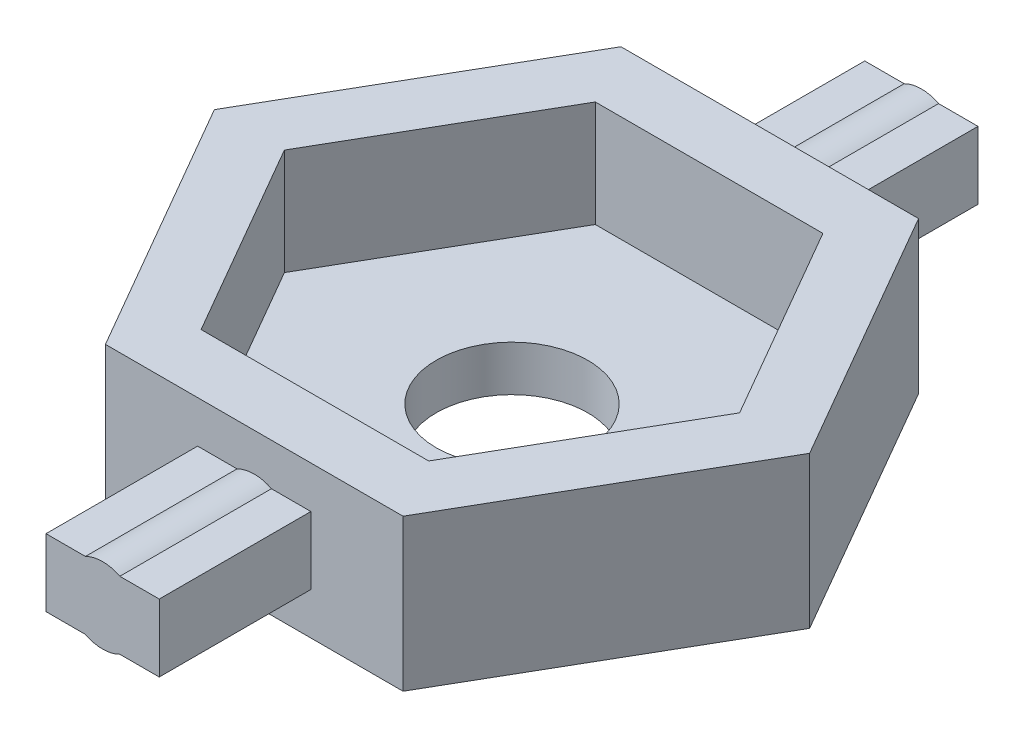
ISO-10303-21;
HEADER;
FILE_DESCRIPTION(('STEP AP214'),'2;1');
FILE_NAME('part.step','',(''),(''),'','','');
FILE_SCHEMA(('AUTOMOTIVE_DESIGN { 1 0 10303 214 1 1 1 1 }'));
ENDSEC;
DATA;
#1=APPLICATION_CONTEXT('core data for automotive mechanical design processes');
#2=APPLICATION_PROTOCOL_DEFINITION('international standard','automotive_design',2000,#1);
#3=PRODUCT_CONTEXT('',#1,'mechanical');
#4=PRODUCT('Part','Part','',(#3));
#5=PRODUCT_RELATED_PRODUCT_CATEGORY('part','',(#4));
#6=PRODUCT_DEFINITION_FORMATION('','',#4);
#7=PRODUCT_DEFINITION_CONTEXT('part definition',#1,'design');
#8=PRODUCT_DEFINITION('design','',#6,#7);
#9=PRODUCT_DEFINITION_SHAPE('','',#8);
#10=(LENGTH_UNIT() NAMED_UNIT(*) SI_UNIT(.MILLI.,.METRE.));
#11=(NAMED_UNIT(*) PLANE_ANGLE_UNIT() SI_UNIT($,.RADIAN.));
#12=(NAMED_UNIT(*) SI_UNIT($,.STERADIAN.) SOLID_ANGLE_UNIT());
#13=UNCERTAINTY_MEASURE_WITH_UNIT(LENGTH_MEASURE(1.E-05),#10,'distance_accuracy_value','');
#14=(GEOMETRIC_REPRESENTATION_CONTEXT(3) GLOBAL_UNCERTAINTY_ASSIGNED_CONTEXT((#13)) GLOBAL_UNIT_ASSIGNED_CONTEXT((#10,
#11,#12)) REPRESENTATION_CONTEXT('',''));
#15=CARTESIAN_POINT('',(0.,0.,0.));
#16=DIRECTION('',(0.,0.,1.));
#17=DIRECTION('',(1.,0.,0.));
#18=AXIS2_PLACEMENT_3D('',#15,#16,#17);
#19=CARTESIAN_POINT('',(0.,2.5,4.25));
#20=DIRECTION('',(0.,0.,-1.));
#21=DIRECTION('',(-1.,0.,0.));
#22=AXIS2_PLACEMENT_3D('',#19,#20,#21);
#23=PLANE('',#22);
#24=DIRECTION('',(1.,0.,0.));
#25=VECTOR('',#24,1.);
#26=CARTESIAN_POINT('',(0.,0.,4.25));
#27=LINE('',#26,#25);
#28=CARTESIAN_POINT('',(-2.45373864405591,0.,4.25));
#29=VERTEX_POINT('',#28);
#30=CARTESIAN_POINT('',(2.45373864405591,0.,4.25));
#31=VERTEX_POINT('',#30);
#32=EDGE_CURVE('E382',#29,#31,#27,.T.);
#33=ORIENTED_EDGE('',*,*,#32,.T.);
#34=DIRECTION('',(0.,-1.,0.));
#35=VECTOR('',#34,1.);
#36=CARTESIAN_POINT('',(2.45373864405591,2.5,4.25));
#37=LINE('',#36,#35);
#38=CARTESIAN_POINT('',(2.45373864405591,2.5,4.25));
#39=VERTEX_POINT('',#38);
#40=EDGE_CURVE('E492',#39,#31,#37,.T.);
#41=ORIENTED_EDGE('',*,*,#40,.F.);
#42=DIRECTION('',(1.,0.,0.));
#43=VECTOR('',#42,1.);
#44=CARTESIAN_POINT('',(0.,2.5,4.25));
#45=LINE('',#44,#43);
#46=CARTESIAN_POINT('',(-2.45373864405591,2.5,4.25));
#47=VERTEX_POINT('',#46);
#48=EDGE_CURVE('E434',#47,#39,#45,.T.);
#49=ORIENTED_EDGE('',*,*,#48,.F.);
#50=DIRECTION('',(0.,-1.,0.));
#51=VECTOR('',#50,1.);
#52=CARTESIAN_POINT('',(-2.45373864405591,2.5,4.25));
#53=LINE('',#52,#51);
#54=EDGE_CURVE('E471',#47,#29,#53,.T.);
#55=ORIENTED_EDGE('',*,*,#54,.T.);
#56=EDGE_LOOP('',(#33,#41,#49,#55));
#57=FACE_BOUND('',#56,.T.);
#58=CARTESIAN_POINT('',(0.,1.25,4.25));
#59=DIRECTION('',(0.,0.,1.));
#60=DIRECTION('',(1.,0.,0.));
#61=AXIS2_PLACEMENT_3D('',#58,#59,#60);
#62=CIRCLE('',#61,0.625);
#63=CARTESIAN_POINT('',(0.283629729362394,1.80693731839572,4.25));
#64=VERTEX_POINT('',#63);
#65=CARTESIAN_POINT('',(-0.283629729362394,1.80693731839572,4.25));
#66=VERTEX_POINT('',#65);
#67=EDGE_CURVE('E58',#64,#66,#62,.T.);
#68=ORIENTED_EDGE('',*,*,#67,.F.);
#69=DIRECTION('',(1.,0.,0.));
#70=VECTOR('',#69,1.);
#71=CARTESIAN_POINT('',(0.283629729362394,1.80693731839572,4.25));
#72=LINE('',#71,#70);
#73=CARTESIAN_POINT('',(0.933679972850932,1.80693731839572,4.25));
#74=VERTEX_POINT('',#73);
#75=EDGE_CURVE('E235',#64,#74,#72,.T.);
#76=ORIENTED_EDGE('',*,*,#75,.T.);
#77=DIRECTION('',(0.,-1.,0.));
#78=VECTOR('',#77,1.);
#79=CARTESIAN_POINT('',(0.933679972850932,1.80693731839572,4.25));
#80=LINE('',#79,#78);
#81=CARTESIAN_POINT('',(0.933679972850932,0.69306268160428,4.25));
#82=VERTEX_POINT('',#81);
#83=EDGE_CURVE('E280',#74,#82,#80,.T.);
#84=ORIENTED_EDGE('',*,*,#83,.T.);
#85=DIRECTION('',(-1.,0.,0.));
#86=VECTOR('',#85,1.);
#87=CARTESIAN_POINT('',(0.933679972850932,0.69306268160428,4.25));
#88=LINE('',#87,#86);
#89=CARTESIAN_POINT('',(0.283629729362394,0.69306268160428,4.25));
#90=VERTEX_POINT('',#89);
#91=EDGE_CURVE('E284',#82,#90,#88,.T.);
#92=ORIENTED_EDGE('',*,*,#91,.T.);
#93=CARTESIAN_POINT('',(0.,1.25,4.25));
#94=DIRECTION('',(0.,0.,1.));
#95=DIRECTION('',(1.,0.,0.));
#96=AXIS2_PLACEMENT_3D('',#93,#94,#95);
#97=CIRCLE('',#96,0.625);
#98=CARTESIAN_POINT('',(-0.283629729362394,0.69306268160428,4.25));
#99=VERTEX_POINT('',#98);
#100=EDGE_CURVE('E288',#99,#90,#97,.T.);
#101=ORIENTED_EDGE('',*,*,#100,.F.);
#102=DIRECTION('',(-1.,0.,0.));
#103=VECTOR('',#102,1.);
#104=CARTESIAN_POINT('',(-0.283629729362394,0.69306268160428,4.25));
#105=LINE('',#104,#103);
#106=CARTESIAN_POINT('',(-0.933679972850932,0.69306268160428,4.25));
#107=VERTEX_POINT('',#106);
#108=EDGE_CURVE('E292',#99,#107,#105,.T.);
#109=ORIENTED_EDGE('',*,*,#108,.T.);
#110=DIRECTION('',(0.,1.,0.));
#111=VECTOR('',#110,1.);
#112=CARTESIAN_POINT('',(-0.933679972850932,0.69306268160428,4.25));
#113=LINE('',#112,#111);
#114=CARTESIAN_POINT('',(-0.933679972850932,1.80693731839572,4.25));
#115=VERTEX_POINT('',#114);
#116=EDGE_CURVE('E296',#107,#115,#113,.T.);
#117=ORIENTED_EDGE('',*,*,#116,.T.);
#118=DIRECTION('',(1.,0.,0.));
#119=VECTOR('',#118,1.);
#120=CARTESIAN_POINT('',(-0.933679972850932,1.80693731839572,4.25));
#121=LINE('',#120,#119);
#122=EDGE_CURVE('E247',#115,#66,#121,.T.);
#123=ORIENTED_EDGE('',*,*,#122,.T.);
#124=EDGE_LOOP('',(#68,#76,#84,#92,#101,#109,#117,#123));
#125=FACE_BOUND('',#124,.T.);
#126=ADVANCED_FACE('F41',(#57,#125),#23,.F.);
#127=CARTESIAN_POINT('',(0.,0.75,0.));
#128=DIRECTION('',(0.,-1.,0.));
#129=DIRECTION('',(0.,0.,-1.));
#130=AXIS2_PLACEMENT_3D('',#127,#128,#129);
#131=CYLINDRICAL_SURFACE('',#130,1.25);
#132=CARTESIAN_POINT('',(0.,0.75,0.));
#133=DIRECTION('',(0.,1.,0.));
#134=DIRECTION('',(0.,0.,1.));
#135=AXIS2_PLACEMENT_3D('',#132,#133,#134);
#136=CIRCLE('',#135,1.25);
#137=CARTESIAN_POINT('',(0.,0.75,1.25));
#138=VERTEX_POINT('',#137);
#139=EDGE_CURVE('E517',#138,#138,#136,.T.);
#140=ORIENTED_EDGE('',*,*,#139,.T.);
#141=EDGE_LOOP('',(#140));
#142=FACE_BOUND('',#141,.T.);
#143=CARTESIAN_POINT('',(0.,0.,0.));
#144=DIRECTION('',(0.,1.,0.));
#145=DIRECTION('',(0.,0.,1.));
#146=AXIS2_PLACEMENT_3D('',#143,#144,#145);
#147=CIRCLE('',#146,1.25);
#148=CARTESIAN_POINT('',(0.,0.,1.25));
#149=VERTEX_POINT('',#148);
#150=EDGE_CURVE('E45',#149,#149,#147,.T.);
#151=ORIENTED_EDGE('',*,*,#150,.F.);
#152=EDGE_LOOP('',(#151));
#153=FACE_BOUND('',#152,.T.);
#154=ADVANCED_FACE('F43',(#142,#153),#131,.F.);
#155=CARTESIAN_POINT('',(0.,0.75,0.));
#156=DIRECTION('',(0.,1.,0.));
#157=DIRECTION('',(0.,0.,1.));
#158=AXIS2_PLACEMENT_3D('',#155,#156,#157);
#159=PLANE('',#158);
#160=ORIENTED_EDGE('',*,*,#139,.F.);
#161=EDGE_LOOP('',(#160));
#162=FACE_BOUND('',#161,.T.);
#163=DIRECTION('',(1.,0.,0.));
#164=VECTOR('',#163,1.);
#165=CARTESIAN_POINT('',(0.,0.75,3.25));
#166=LINE('',#165,#164);
#167=CARTESIAN_POINT('',(-1.87638837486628,0.75,3.25));
#168=VERTEX_POINT('',#167);
#169=CARTESIAN_POINT('',(1.87638837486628,0.75,3.25));
#170=VERTEX_POINT('',#169);
#171=EDGE_CURVE('E521',#168,#170,#166,.T.);
#172=ORIENTED_EDGE('',*,*,#171,.T.);
#173=DIRECTION('',(0.5,0.,-0.866025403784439));
#174=VECTOR('',#173,1.);
#175=CARTESIAN_POINT('',(2.81458256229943,0.75,1.625));
#176=LINE('',#175,#174);
#177=CARTESIAN_POINT('',(3.75277674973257,0.75,0.));
#178=VERTEX_POINT('',#177);
#179=EDGE_CURVE('E525',#170,#178,#176,.T.);
#180=ORIENTED_EDGE('',*,*,#179,.T.);
#181=DIRECTION('',(-0.5,0.,-0.866025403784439));
#182=VECTOR('',#181,1.);
#183=CARTESIAN_POINT('',(2.81458256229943,0.75,-1.625));
#184=LINE('',#183,#182);
#185=CARTESIAN_POINT('',(1.87638837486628,0.75,-3.25));
#186=VERTEX_POINT('',#185);
#187=EDGE_CURVE('E529',#178,#186,#184,.T.);
#188=ORIENTED_EDGE('',*,*,#187,.T.);
#189=DIRECTION('',(-1.,0.,0.));
#190=VECTOR('',#189,1.);
#191=CARTESIAN_POINT('',(0.,0.75,-3.25));
#192=LINE('',#191,#190);
#193=CARTESIAN_POINT('',(-1.87638837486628,0.75,-3.25));
#194=VERTEX_POINT('',#193);
#195=EDGE_CURVE('E533',#186,#194,#192,.T.);
#196=ORIENTED_EDGE('',*,*,#195,.T.);
#197=DIRECTION('',(-0.5,0.,0.866025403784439));
#198=VECTOR('',#197,1.);
#199=CARTESIAN_POINT('',(-2.81458256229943,0.75,-1.625));
#200=LINE('',#199,#198);
#201=CARTESIAN_POINT('',(-3.75277674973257,0.75,0.));
#202=VERTEX_POINT('',#201);
#203=EDGE_CURVE('E51',#194,#202,#200,.T.);
#204=ORIENTED_EDGE('',*,*,#203,.T.);
#205=DIRECTION('',(0.5,0.,0.866025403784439));
#206=VECTOR('',#205,1.);
#207=CARTESIAN_POINT('',(-2.81458256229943,0.75,1.625));
#208=LINE('',#207,#206);
#209=EDGE_CURVE('E11',#202,#168,#208,.T.);
#210=ORIENTED_EDGE('',*,*,#209,.T.);
#211=EDGE_LOOP('',(#172,#180,#188,#196,#204,#210));
#212=FACE_BOUND('',#211,.T.);
#213=ADVANCED_FACE('F540',(#162,#212),#159,.T.);
#214=CARTESIAN_POINT('',(0.,0.,0.));
#215=DIRECTION('',(0.,1.,0.));
#216=DIRECTION('',(0.,0.,1.));
#217=AXIS2_PLACEMENT_3D('',#214,#215,#216);
#218=PLANE('',#217);
#219=ORIENTED_EDGE('',*,*,#150,.T.);
#220=EDGE_LOOP('',(#219));
#221=FACE_BOUND('',#220,.T.);
#222=ORIENTED_EDGE('',*,*,#32,.F.);
#223=DIRECTION('',(0.5,0.,0.866025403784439));
#224=VECTOR('',#223,1.);
#225=CARTESIAN_POINT('',(-3.68060796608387,0.,2.125));
#226=LINE('',#225,#224);
#227=CARTESIAN_POINT('',(-4.90747728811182,0.,0.));
#228=VERTEX_POINT('',#227);
#229=EDGE_CURVE('E414',#228,#29,#226,.T.);
#230=ORIENTED_EDGE('',*,*,#229,.F.);
#231=DIRECTION('',(-0.5,0.,0.866025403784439));
#232=VECTOR('',#231,1.);
#233=CARTESIAN_POINT('',(-3.68060796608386,0.,-2.125));
#234=LINE('',#233,#232);
#235=CARTESIAN_POINT('',(-2.45373864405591,0.,-4.25));
#236=VERTEX_POINT('',#235);
#237=EDGE_CURVE('E466',#236,#228,#234,.T.);
#238=ORIENTED_EDGE('',*,*,#237,.F.);
#239=DIRECTION('',(-1.,0.,0.));
#240=VECTOR('',#239,1.);
#241=CARTESIAN_POINT('',(0.,0.,-4.25));
#242=LINE('',#241,#240);
#243=CARTESIAN_POINT('',(2.45373864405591,0.,-4.25));
#244=VERTEX_POINT('',#243);
#245=EDGE_CURVE('E463',#244,#236,#242,.T.);
#246=ORIENTED_EDGE('',*,*,#245,.F.);
#247=DIRECTION('',(-0.5,0.,-0.866025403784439));
#248=VECTOR('',#247,1.);
#249=CARTESIAN_POINT('',(3.68060796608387,0.,-2.125));
#250=LINE('',#249,#248);
#251=CARTESIAN_POINT('',(4.90747728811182,0.,0.));
#252=VERTEX_POINT('',#251);
#253=EDGE_CURVE('E460',#252,#244,#250,.T.);
#254=ORIENTED_EDGE('',*,*,#253,.F.);
#255=DIRECTION('',(0.5,0.,-0.866025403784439));
#256=VECTOR('',#255,1.);
#257=CARTESIAN_POINT('',(3.68060796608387,0.,2.125));
#258=LINE('',#257,#256);
#259=EDGE_CURVE('E457',#31,#252,#258,.T.);
#260=ORIENTED_EDGE('',*,*,#259,.F.);
#261=EDGE_LOOP('',(#222,#230,#238,#246,#254,#260));
#262=FACE_BOUND('',#261,.T.);
#263=ADVANCED_FACE('F847',(#221,#262),#218,.F.);
#264=CARTESIAN_POINT('',(3.68060796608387,2.5,2.125));
#265=DIRECTION('',(-0.866025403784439,0.,-0.5));
#266=DIRECTION('',(-0.5,0.,0.866025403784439));
#267=AXIS2_PLACEMENT_3D('',#264,#265,#266);
#268=PLANE('',#267);
#269=ORIENTED_EDGE('',*,*,#259,.T.);
#270=DIRECTION('',(0.,-1.,0.));
#271=VECTOR('',#270,1.);
#272=CARTESIAN_POINT('',(4.90747728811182,2.5,0.));
#273=LINE('',#272,#271);
#274=CARTESIAN_POINT('',(4.90747728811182,2.5,0.));
#275=VERTEX_POINT('',#274);
#276=EDGE_CURVE('E488',#275,#252,#273,.T.);
#277=ORIENTED_EDGE('',*,*,#276,.F.);
#278=DIRECTION('',(0.5,0.,-0.866025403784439));
#279=VECTOR('',#278,1.);
#280=CARTESIAN_POINT('',(3.68060796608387,2.5,2.125));
#281=LINE('',#280,#279);
#282=EDGE_CURVE('E438',#39,#275,#281,.T.);
#283=ORIENTED_EDGE('',*,*,#282,.F.);
#284=ORIENTED_EDGE('',*,*,#40,.T.);
#285=EDGE_LOOP('',(#269,#277,#283,#284));
#286=FACE_BOUND('',#285,.T.);
#287=ADVANCED_FACE('F581',(#286),#268,.F.);
#288=CARTESIAN_POINT('',(3.68060796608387,2.5,-2.125));
#289=DIRECTION('',(-0.866025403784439,0.,0.5));
#290=DIRECTION('',(0.5,0.,0.866025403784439));
#291=AXIS2_PLACEMENT_3D('',#288,#289,#290);
#292=PLANE('',#291);
#293=ORIENTED_EDGE('',*,*,#253,.T.);
#294=DIRECTION('',(0.,-1.,0.));
#295=VECTOR('',#294,1.);
#296=CARTESIAN_POINT('',(2.45373864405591,2.5,-4.25));
#297=LINE('',#296,#295);
#298=CARTESIAN_POINT('',(2.45373864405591,2.5,-4.25));
#299=VERTEX_POINT('',#298);
#300=EDGE_CURVE('E484',#299,#244,#297,.T.);
#301=ORIENTED_EDGE('',*,*,#300,.F.);
#302=DIRECTION('',(-0.5,0.,-0.866025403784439));
#303=VECTOR('',#302,1.);
#304=CARTESIAN_POINT('',(3.68060796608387,2.5,-2.125));
#305=LINE('',#304,#303);
#306=EDGE_CURVE('E441',#275,#299,#305,.T.);
#307=ORIENTED_EDGE('',*,*,#306,.F.);
#308=ORIENTED_EDGE('',*,*,#276,.T.);
#309=EDGE_LOOP('',(#293,#301,#307,#308));
#310=FACE_BOUND('',#309,.T.);
#311=ADVANCED_FACE('F833',(#310),#292,.F.);
#312=CARTESIAN_POINT('',(0.,2.5,-4.25));
#313=DIRECTION('',(0.,0.,1.));
#314=DIRECTION('',(1.,0.,0.));
#315=AXIS2_PLACEMENT_3D('',#312,#313,#314);
#316=PLANE('',#315);
#317=DIRECTION('',(1.,0.,0.));
#318=VECTOR('',#317,1.);
#319=CARTESIAN_POINT('',(0.283629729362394,1.80693731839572,-4.25));
#320=LINE('',#319,#318);
#321=CARTESIAN_POINT('',(0.283629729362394,1.80693731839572,-4.25));
#322=VERTEX_POINT('',#321);
#323=CARTESIAN_POINT('',(0.933679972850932,1.80693731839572,-4.25));
#324=VERTEX_POINT('',#323);
#325=EDGE_CURVE('E327',#322,#324,#320,.T.);
#326=ORIENTED_EDGE('',*,*,#325,.F.);
#327=CARTESIAN_POINT('',(0.,1.25,-4.25));
#328=DIRECTION('',(0.,0.,1.));
#329=DIRECTION('',(1.,0.,0.));
#330=AXIS2_PLACEMENT_3D('',#327,#328,#329);
#331=CIRCLE('',#330,0.625);
#332=CARTESIAN_POINT('',(-0.283629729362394,1.80693731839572,-4.25));
#333=VERTEX_POINT('',#332);
#334=EDGE_CURVE('E66',#322,#333,#331,.T.);
#335=ORIENTED_EDGE('',*,*,#334,.T.);
#336=DIRECTION('',(1.,0.,0.));
#337=VECTOR('',#336,1.);
#338=CARTESIAN_POINT('',(-0.933679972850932,1.80693731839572,-4.25));
#339=LINE('',#338,#337);
#340=CARTESIAN_POINT('',(-0.933679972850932,1.80693731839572,-4.25));
#341=VERTEX_POINT('',#340);
#342=EDGE_CURVE('E352',#341,#333,#339,.T.);
#343=ORIENTED_EDGE('',*,*,#342,.F.);
#344=DIRECTION('',(0.,1.,0.));
#345=VECTOR('',#344,1.);
#346=CARTESIAN_POINT('',(-0.933679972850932,0.69306268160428,-4.25));
#347=LINE('',#346,#345);
#348=CARTESIAN_POINT('',(-0.933679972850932,0.69306268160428,-4.25));
#349=VERTEX_POINT('',#348);
#350=EDGE_CURVE('E356',#349,#341,#347,.T.);
#351=ORIENTED_EDGE('',*,*,#350,.F.);
#352=DIRECTION('',(-1.,0.,0.));
#353=VECTOR('',#352,1.);
#354=CARTESIAN_POINT('',(-0.283629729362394,0.69306268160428,-4.25));
#355=LINE('',#354,#353);
#356=CARTESIAN_POINT('',(-0.283629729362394,0.69306268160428,-4.25));
#357=VERTEX_POINT('',#356);
#358=EDGE_CURVE('E360',#357,#349,#355,.T.);
#359=ORIENTED_EDGE('',*,*,#358,.F.);
#360=CARTESIAN_POINT('',(0.,1.25,-4.25));
#361=DIRECTION('',(0.,0.,1.));
#362=DIRECTION('',(1.,0.,0.));
#363=AXIS2_PLACEMENT_3D('',#360,#361,#362);
#364=CIRCLE('',#363,0.625);
#365=CARTESIAN_POINT('',(0.283629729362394,0.69306268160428,-4.25));
#366=VERTEX_POINT('',#365);
#367=EDGE_CURVE('E364',#357,#366,#364,.T.);
#368=ORIENTED_EDGE('',*,*,#367,.T.);
#369=DIRECTION('',(-1.,0.,0.));
#370=VECTOR('',#369,1.);
#371=CARTESIAN_POINT('',(0.933679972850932,0.69306268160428,-4.25));
#372=LINE('',#371,#370);
#373=CARTESIAN_POINT('',(0.933679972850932,0.69306268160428,-4.25));
#374=VERTEX_POINT('',#373);
#375=EDGE_CURVE('E367',#374,#366,#372,.T.);
#376=ORIENTED_EDGE('',*,*,#375,.F.);
#377=DIRECTION('',(0.,-1.,0.));
#378=VECTOR('',#377,1.);
#379=CARTESIAN_POINT('',(0.933679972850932,1.80693731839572,-4.25));
#380=LINE('',#379,#378);
#381=EDGE_CURVE('E371',#324,#374,#380,.T.);
#382=ORIENTED_EDGE('',*,*,#381,.F.);
#383=EDGE_LOOP('',(#326,#335,#343,#351,#359,#368,#376,#382));
#384=FACE_BOUND('',#383,.T.);
#385=ORIENTED_EDGE('',*,*,#245,.T.);
#386=DIRECTION('',(0.,-1.,0.));
#387=VECTOR('',#386,1.);
#388=CARTESIAN_POINT('',(-2.45373864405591,2.5,-4.25));
#389=LINE('',#388,#387);
#390=CARTESIAN_POINT('',(-2.45373864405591,2.5,-4.25));
#391=VERTEX_POINT('',#390);
#392=EDGE_CURVE('E480',#391,#236,#389,.T.);
#393=ORIENTED_EDGE('',*,*,#392,.F.);
#394=DIRECTION('',(-1.,0.,0.));
#395=VECTOR('',#394,1.);
#396=CARTESIAN_POINT('',(0.,2.5,-4.25));
#397=LINE('',#396,#395);
#398=EDGE_CURVE('E444',#299,#391,#397,.T.);
#399=ORIENTED_EDGE('',*,*,#398,.F.);
#400=ORIENTED_EDGE('',*,*,#300,.T.);
#401=EDGE_LOOP('',(#385,#393,#399,#400));
#402=FACE_BOUND('',#401,.T.);
#403=ADVANCED_FACE('F824',(#384,#402),#316,.F.);
#404=CARTESIAN_POINT('',(-3.68060796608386,2.5,-2.125));
#405=DIRECTION('',(0.866025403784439,0.,0.5));
#406=DIRECTION('',(0.5,0.,-0.866025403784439));
#407=AXIS2_PLACEMENT_3D('',#404,#405,#406);
#408=PLANE('',#407);
#409=ORIENTED_EDGE('',*,*,#237,.T.);
#410=DIRECTION('',(0.,-1.,0.));
#411=VECTOR('',#410,1.);
#412=CARTESIAN_POINT('',(-4.90747728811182,2.5,0.));
#413=LINE('',#412,#411);
#414=CARTESIAN_POINT('',(-4.90747728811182,2.5,0.));
#415=VERTEX_POINT('',#414);
#416=EDGE_CURVE('E475',#415,#228,#413,.T.);
#417=ORIENTED_EDGE('',*,*,#416,.F.);
#418=DIRECTION('',(-0.5,0.,0.866025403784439));
#419=VECTOR('',#418,1.);
#420=CARTESIAN_POINT('',(-3.68060796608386,2.5,-2.125));
#421=LINE('',#420,#419);
#422=EDGE_CURVE('E447',#391,#415,#421,.T.);
#423=ORIENTED_EDGE('',*,*,#422,.F.);
#424=ORIENTED_EDGE('',*,*,#392,.T.);
#425=EDGE_LOOP('',(#409,#417,#423,#424));
#426=FACE_BOUND('',#425,.T.);
#427=ADVANCED_FACE('F816',(#426),#408,.F.);
#428=CARTESIAN_POINT('',(2.81458256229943,2.5,1.625));
#429=DIRECTION('',(-0.866025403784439,0.,-0.5));
#430=DIRECTION('',(-0.5,0.,0.866025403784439));
#431=AXIS2_PLACEMENT_3D('',#428,#429,#430);
#432=PLANE('',#431);
#433=DIRECTION('',(0.,-1.,0.));
#434=VECTOR('',#433,1.);
#435=CARTESIAN_POINT('',(3.75277674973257,2.5,0.));
#436=LINE('',#435,#434);
#437=CARTESIAN_POINT('',(3.75277674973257,2.5,0.));
#438=VERTEX_POINT('',#437);
#439=EDGE_CURVE('E453',#438,#178,#436,.T.);
#440=ORIENTED_EDGE('',*,*,#439,.T.);
#441=ORIENTED_EDGE('',*,*,#179,.F.);
#442=DIRECTION('',(0.,-1.,0.));
#443=VECTOR('',#442,1.);
#444=CARTESIAN_POINT('',(1.87638837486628,2.5,3.25));
#445=LINE('',#444,#443);
#446=CARTESIAN_POINT('',(1.87638837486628,2.5,3.25));
#447=VERTEX_POINT('',#446);
#448=EDGE_CURVE('E476',#447,#170,#445,.T.);
#449=ORIENTED_EDGE('',*,*,#448,.F.);
#450=DIRECTION('',(0.5,0.,-0.866025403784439));
#451=VECTOR('',#450,1.);
#452=CARTESIAN_POINT('',(2.81458256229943,2.5,1.625));
#453=LINE('',#452,#451);
#454=EDGE_CURVE('E409',#447,#438,#453,.T.);
#455=ORIENTED_EDGE('',*,*,#454,.T.);
#456=EDGE_LOOP('',(#440,#441,#449,#455));
#457=FACE_BOUND('',#456,.T.);
#458=ADVANCED_FACE('F557',(#457),#432,.T.);
#459=CARTESIAN_POINT('',(0.,2.5,3.25));
#460=DIRECTION('',(0.,0.,-1.));
#461=DIRECTION('',(-1.,0.,0.));
#462=AXIS2_PLACEMENT_3D('',#459,#460,#461);
#463=PLANE('',#462);
#464=ORIENTED_EDGE('',*,*,#448,.T.);
#465=ORIENTED_EDGE('',*,*,#171,.F.);
#466=DIRECTION('',(0.,-1.,0.));
#467=VECTOR('',#466,1.);
#468=CARTESIAN_POINT('',(-1.87638837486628,2.5,3.25));
#469=LINE('',#468,#467);
#470=CARTESIAN_POINT('',(-1.87638837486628,2.5,3.25));
#471=VERTEX_POINT('',#470);
#472=EDGE_CURVE('E510',#471,#168,#469,.T.);
#473=ORIENTED_EDGE('',*,*,#472,.F.);
#474=DIRECTION('',(1.,0.,0.));
#475=VECTOR('',#474,1.);
#476=CARTESIAN_POINT('',(0.,2.5,3.25));
#477=LINE('',#476,#475);
#478=EDGE_CURVE('E413',#471,#447,#477,.T.);
#479=ORIENTED_EDGE('',*,*,#478,.T.);
#480=EDGE_LOOP('',(#464,#465,#473,#479));
#481=FACE_BOUND('',#480,.T.);
#482=ADVANCED_FACE('F560',(#481),#463,.T.);
#483=CARTESIAN_POINT('',(-2.81458256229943,2.5,1.625));
#484=DIRECTION('',(0.866025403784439,0.,-0.5));
#485=DIRECTION('',(-0.5,0.,-0.866025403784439));
#486=AXIS2_PLACEMENT_3D('',#483,#484,#485);
#487=PLANE('',#486);
#488=ORIENTED_EDGE('',*,*,#472,.T.);
#489=ORIENTED_EDGE('',*,*,#209,.F.);
#490=DIRECTION('',(0.,-1.,0.));
#491=VECTOR('',#490,1.);
#492=CARTESIAN_POINT('',(-3.75277674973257,2.5,0.));
#493=LINE('',#492,#491);
#494=CARTESIAN_POINT('',(-3.75277674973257,2.5,0.));
#495=VERTEX_POINT('',#494);
#496=EDGE_CURVE('E506',#495,#202,#493,.T.);
#497=ORIENTED_EDGE('',*,*,#496,.F.);
#498=DIRECTION('',(0.5,0.,0.866025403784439));
#499=VECTOR('',#498,1.);
#500=CARTESIAN_POINT('',(-2.81458256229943,2.5,1.625));
#501=LINE('',#500,#499);
#502=EDGE_CURVE('E418',#495,#471,#501,.T.);
#503=ORIENTED_EDGE('',*,*,#502,.T.);
#504=EDGE_LOOP('',(#488,#489,#497,#503));
#505=FACE_BOUND('',#504,.T.);
#506=ADVANCED_FACE('F562',(#505),#487,.T.);
#507=CARTESIAN_POINT('',(-2.81458256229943,2.5,-1.625));
#508=DIRECTION('',(0.866025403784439,0.,0.5));
#509=DIRECTION('',(0.5,0.,-0.866025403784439));
#510=AXIS2_PLACEMENT_3D('',#507,#508,#509);
#511=PLANE('',#510);
#512=ORIENTED_EDGE('',*,*,#496,.T.);
#513=ORIENTED_EDGE('',*,*,#203,.F.);
#514=DIRECTION('',(0.,-1.,0.));
#515=VECTOR('',#514,1.);
#516=CARTESIAN_POINT('',(-1.87638837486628,2.5,-3.25));
#517=LINE('',#516,#515);
#518=CARTESIAN_POINT('',(-1.87638837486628,2.5,-3.25));
#519=VERTEX_POINT('',#518);
#520=EDGE_CURVE('E502',#519,#194,#517,.T.);
#521=ORIENTED_EDGE('',*,*,#520,.F.);
#522=DIRECTION('',(-0.5,0.,0.866025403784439));
#523=VECTOR('',#522,1.);
#524=CARTESIAN_POINT('',(-2.81458256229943,2.5,-1.625));
#525=LINE('',#524,#523);
#526=EDGE_CURVE('E422',#519,#495,#525,.T.);
#527=ORIENTED_EDGE('',*,*,#526,.T.);
#528=EDGE_LOOP('',(#512,#513,#521,#527));
#529=FACE_BOUND('',#528,.T.);
#530=ADVANCED_FACE('F543',(#529),#511,.T.);
#531=CARTESIAN_POINT('',(0.,2.5,-3.25));
#532=DIRECTION('',(0.,0.,1.));
#533=DIRECTION('',(1.,0.,0.));
#534=AXIS2_PLACEMENT_3D('',#531,#532,#533);
#535=PLANE('',#534);
#536=ORIENTED_EDGE('',*,*,#520,.T.);
#537=ORIENTED_EDGE('',*,*,#195,.F.);
#538=DIRECTION('',(0.,-1.,0.));
#539=VECTOR('',#538,1.);
#540=CARTESIAN_POINT('',(1.87638837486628,2.5,-3.25));
#541=LINE('',#540,#539);
#542=CARTESIAN_POINT('',(1.87638837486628,2.5,-3.25));
#543=VERTEX_POINT('',#542);
#544=EDGE_CURVE('E499',#543,#186,#541,.T.);
#545=ORIENTED_EDGE('',*,*,#544,.F.);
#546=DIRECTION('',(-1.,0.,0.));
#547=VECTOR('',#546,1.);
#548=CARTESIAN_POINT('',(0.,2.5,-3.25));
#549=LINE('',#548,#547);
#550=EDGE_CURVE('E426',#543,#519,#549,.T.);
#551=ORIENTED_EDGE('',*,*,#550,.T.);
#552=EDGE_LOOP('',(#536,#537,#545,#551));
#553=FACE_BOUND('',#552,.T.);
#554=ADVANCED_FACE('F546',(#553),#535,.T.);
#555=CARTESIAN_POINT('',(2.81458256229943,2.5,-1.625));
#556=DIRECTION('',(-0.866025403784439,0.,0.5));
#557=DIRECTION('',(0.5,0.,0.866025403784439));
#558=AXIS2_PLACEMENT_3D('',#555,#556,#557);
#559=PLANE('',#558);
#560=ORIENTED_EDGE('',*,*,#544,.T.);
#561=ORIENTED_EDGE('',*,*,#187,.F.);
#562=ORIENTED_EDGE('',*,*,#439,.F.);
#563=DIRECTION('',(-0.5,0.,-0.866025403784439));
#564=VECTOR('',#563,1.);
#565=CARTESIAN_POINT('',(2.81458256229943,2.5,-1.625));
#566=LINE('',#565,#564);
#567=EDGE_CURVE('E430',#438,#543,#566,.T.);
#568=ORIENTED_EDGE('',*,*,#567,.T.);
#569=EDGE_LOOP('',(#560,#561,#562,#568));
#570=FACE_BOUND('',#569,.T.);
#571=ADVANCED_FACE('F555',(#570),#559,.T.);
#572=CARTESIAN_POINT('',(-3.68060796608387,2.5,2.125));
#573=DIRECTION('',(0.866025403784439,0.,-0.5));
#574=DIRECTION('',(-0.5,0.,-0.866025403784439));
#575=AXIS2_PLACEMENT_3D('',#572,#573,#574);
#576=PLANE('',#575);
#577=ORIENTED_EDGE('',*,*,#229,.T.);
#578=ORIENTED_EDGE('',*,*,#54,.F.);
#579=DIRECTION('',(0.5,0.,0.866025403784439));
#580=VECTOR('',#579,1.);
#581=CARTESIAN_POINT('',(-3.68060796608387,2.5,2.125));
#582=LINE('',#581,#580);
#583=EDGE_CURVE('E450',#415,#47,#582,.T.);
#584=ORIENTED_EDGE('',*,*,#583,.F.);
#585=ORIENTED_EDGE('',*,*,#416,.T.);
#586=EDGE_LOOP('',(#577,#578,#584,#585));
#587=FACE_BOUND('',#586,.T.);
#588=ADVANCED_FACE('F585',(#587),#576,.F.);
#589=CARTESIAN_POINT('',(0.,2.5,0.));
#590=DIRECTION('',(0.,1.,0.));
#591=DIRECTION('',(0.,0.,1.));
#592=AXIS2_PLACEMENT_3D('',#589,#590,#591);
#593=PLANE('',#592);
#594=ORIENTED_EDGE('',*,*,#454,.F.);
#595=ORIENTED_EDGE('',*,*,#478,.F.);
#596=ORIENTED_EDGE('',*,*,#502,.F.);
#597=ORIENTED_EDGE('',*,*,#526,.F.);
#598=ORIENTED_EDGE('',*,*,#550,.F.);
#599=ORIENTED_EDGE('',*,*,#567,.F.);
#600=EDGE_LOOP('',(#594,#595,#596,#597,#598,#599));
#601=FACE_BOUND('',#600,.T.);
#602=ORIENTED_EDGE('',*,*,#48,.T.);
#603=ORIENTED_EDGE('',*,*,#282,.T.);
#604=ORIENTED_EDGE('',*,*,#306,.T.);
#605=ORIENTED_EDGE('',*,*,#398,.T.);
#606=ORIENTED_EDGE('',*,*,#422,.T.);
#607=ORIENTED_EDGE('',*,*,#583,.T.);
#608=EDGE_LOOP('',(#602,#603,#604,#605,#606,#607));
#609=FACE_BOUND('',#608,.T.);
#610=ADVANCED_FACE('F551',(#601,#609),#593,.T.);
#611=CARTESIAN_POINT('',(0.,1.25,-6.75));
#612=DIRECTION('',(0.,0.,1.));
#613=DIRECTION('',(1.,0.,0.));
#614=AXIS2_PLACEMENT_3D('',#611,#612,#613);
#615=CYLINDRICAL_SURFACE('',#614,0.625);
#616=ORIENTED_EDGE('',*,*,#334,.F.);
#617=DIRECTION('',(0.,0.,1.));
#618=VECTOR('',#617,1.);
#619=CARTESIAN_POINT('',(0.283629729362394,1.80693731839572,-6.75));
#620=LINE('',#619,#618);
#621=CARTESIAN_POINT('',(0.283629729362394,1.80693731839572,-6.75));
#622=VERTEX_POINT('',#621);
#623=EDGE_CURVE('E378',#622,#322,#620,.T.);
#624=ORIENTED_EDGE('',*,*,#623,.F.);
#625=CARTESIAN_POINT('',(0.,1.25,-6.75));
#626=DIRECTION('',(0.,0.,1.));
#627=DIRECTION('',(1.,0.,0.));
#628=AXIS2_PLACEMENT_3D('',#625,#626,#627);
#629=CIRCLE('',#628,0.625);
#630=CARTESIAN_POINT('',(-0.283629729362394,1.80693731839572,-6.75));
#631=VERTEX_POINT('',#630);
#632=EDGE_CURVE('E322',#622,#631,#629,.T.);
#633=ORIENTED_EDGE('',*,*,#632,.T.);
#634=DIRECTION('',(0.,0.,1.));
#635=VECTOR('',#634,1.);
#636=CARTESIAN_POINT('',(-0.283629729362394,1.80693731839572,-6.75));
#637=LINE('',#636,#635);
#638=EDGE_CURVE('E349',#631,#333,#637,.T.);
#639=ORIENTED_EDGE('',*,*,#638,.T.);
#640=EDGE_LOOP('',(#616,#624,#633,#639));
#641=FACE_BOUND('',#640,.T.);
#642=ADVANCED_FACE('F608',(#641),#615,.T.);
#643=CARTESIAN_POINT('',(0.283629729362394,1.80693731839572,-6.75));
#644=DIRECTION('',(0.,-1.,0.));
#645=DIRECTION('',(0.,0.,-1.));
#646=AXIS2_PLACEMENT_3D('',#643,#644,#645);
#647=PLANE('',#646);
#648=ORIENTED_EDGE('',*,*,#325,.T.);
#649=DIRECTION('',(0.,0.,1.));
#650=VECTOR('',#649,1.);
#651=CARTESIAN_POINT('',(0.933679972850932,1.80693731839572,-6.75));
#652=LINE('',#651,#650);
#653=CARTESIAN_POINT('',(0.933679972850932,1.80693731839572,-6.75));
#654=VERTEX_POINT('',#653);
#655=EDGE_CURVE('E383',#654,#324,#652,.T.);
#656=ORIENTED_EDGE('',*,*,#655,.F.);
#657=DIRECTION('',(1.,0.,0.));
#658=VECTOR('',#657,1.);
#659=CARTESIAN_POINT('',(0.283629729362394,1.80693731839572,-6.75));
#660=LINE('',#659,#658);
#661=EDGE_CURVE('E346',#622,#654,#660,.T.);
#662=ORIENTED_EDGE('',*,*,#661,.F.);
#663=ORIENTED_EDGE('',*,*,#623,.T.);
#664=EDGE_LOOP('',(#648,#656,#662,#663));
#665=FACE_BOUND('',#664,.T.);
#666=ADVANCED_FACE('F616',(#665),#647,.F.);
#667=CARTESIAN_POINT('',(0.933679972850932,1.80693731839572,-6.75));
#668=DIRECTION('',(-1.,0.,0.));
#669=DIRECTION('',(0.,0.,1.));
#670=AXIS2_PLACEMENT_3D('',#667,#668,#669);
#671=PLANE('',#670);
#672=ORIENTED_EDGE('',*,*,#381,.T.);
#673=DIRECTION('',(0.,0.,1.));
#674=VECTOR('',#673,1.);
#675=CARTESIAN_POINT('',(0.933679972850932,0.69306268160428,-6.75));
#676=LINE('',#675,#674);
#677=CARTESIAN_POINT('',(0.933679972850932,0.69306268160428,-6.75));
#678=VERTEX_POINT('',#677);
#679=EDGE_CURVE('E387',#678,#374,#676,.T.);
#680=ORIENTED_EDGE('',*,*,#679,.F.);
#681=DIRECTION('',(0.,-1.,0.));
#682=VECTOR('',#681,1.);
#683=CARTESIAN_POINT('',(0.933679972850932,1.80693731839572,-6.75));
#684=LINE('',#683,#682);
#685=EDGE_CURVE('E343',#654,#678,#684,.T.);
#686=ORIENTED_EDGE('',*,*,#685,.F.);
#687=ORIENTED_EDGE('',*,*,#655,.T.);
#688=EDGE_LOOP('',(#672,#680,#686,#687));
#689=FACE_BOUND('',#688,.T.);
#690=ADVANCED_FACE('F624',(#689),#671,.F.);
#691=CARTESIAN_POINT('',(0.933679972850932,0.69306268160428,-6.75));
#692=DIRECTION('',(0.,1.,0.));
#693=DIRECTION('',(0.,0.,1.));
#694=AXIS2_PLACEMENT_3D('',#691,#692,#693);
#695=PLANE('',#694);
#696=ORIENTED_EDGE('',*,*,#375,.T.);
#697=DIRECTION('',(0.,0.,1.));
#698=VECTOR('',#697,1.);
#699=CARTESIAN_POINT('',(0.283629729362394,0.69306268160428,-6.75));
#700=LINE('',#699,#698);
#701=CARTESIAN_POINT('',(0.283629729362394,0.69306268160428,-6.75));
#702=VERTEX_POINT('',#701);
#703=EDGE_CURVE('E391',#702,#366,#700,.T.);
#704=ORIENTED_EDGE('',*,*,#703,.F.);
#705=DIRECTION('',(-1.,0.,0.));
#706=VECTOR('',#705,1.);
#707=CARTESIAN_POINT('',(0.933679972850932,0.69306268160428,-6.75));
#708=LINE('',#707,#706);
#709=EDGE_CURVE('E340',#678,#702,#708,.T.);
#710=ORIENTED_EDGE('',*,*,#709,.F.);
#711=ORIENTED_EDGE('',*,*,#679,.T.);
#712=EDGE_LOOP('',(#696,#704,#710,#711));
#713=FACE_BOUND('',#712,.T.);
#714=ADVANCED_FACE('F632',(#713),#695,.F.);
#715=CARTESIAN_POINT('',(0.,1.25,-6.75));
#716=DIRECTION('',(0.,0.,1.));
#717=DIRECTION('',(1.,0.,0.));
#718=AXIS2_PLACEMENT_3D('',#715,#716,#717);
#719=CYLINDRICAL_SURFACE('',#718,0.625);
#720=ORIENTED_EDGE('',*,*,#367,.F.);
#721=DIRECTION('',(0.,0.,1.));
#722=VECTOR('',#721,1.);
#723=CARTESIAN_POINT('',(-0.283629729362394,0.69306268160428,-6.75));
#724=LINE('',#723,#722);
#725=CARTESIAN_POINT('',(-0.283629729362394,0.69306268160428,-6.75));
#726=VERTEX_POINT('',#725);
#727=EDGE_CURVE('E395',#726,#357,#724,.T.);
#728=ORIENTED_EDGE('',*,*,#727,.F.);
#729=CARTESIAN_POINT('',(0.,1.25,-6.75));
#730=DIRECTION('',(0.,0.,1.));
#731=DIRECTION('',(1.,0.,0.));
#732=AXIS2_PLACEMENT_3D('',#729,#730,#731);
#733=CIRCLE('',#732,0.625);
#734=EDGE_CURVE('E336',#726,#702,#733,.T.);
#735=ORIENTED_EDGE('',*,*,#734,.T.);
#736=ORIENTED_EDGE('',*,*,#703,.T.);
#737=EDGE_LOOP('',(#720,#728,#735,#736));
#738=FACE_BOUND('',#737,.T.);
#739=ADVANCED_FACE('F640',(#738),#719,.T.);
#740=CARTESIAN_POINT('',(-0.283629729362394,0.69306268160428,-6.75));
#741=DIRECTION('',(0.,1.,0.));
#742=DIRECTION('',(0.,0.,1.));
#743=AXIS2_PLACEMENT_3D('',#740,#741,#742);
#744=PLANE('',#743);
#745=ORIENTED_EDGE('',*,*,#358,.T.);
#746=DIRECTION('',(0.,0.,1.));
#747=VECTOR('',#746,1.);
#748=CARTESIAN_POINT('',(-0.933679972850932,0.69306268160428,-6.75));
#749=LINE('',#748,#747);
#750=CARTESIAN_POINT('',(-0.933679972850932,0.69306268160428,-6.75));
#751=VERTEX_POINT('',#750);
#752=EDGE_CURVE('E399',#751,#349,#749,.T.);
#753=ORIENTED_EDGE('',*,*,#752,.F.);
#754=DIRECTION('',(-1.,0.,0.));
#755=VECTOR('',#754,1.);
#756=CARTESIAN_POINT('',(-0.283629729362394,0.69306268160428,-6.75));
#757=LINE('',#756,#755);
#758=EDGE_CURVE('E333',#726,#751,#757,.T.);
#759=ORIENTED_EDGE('',*,*,#758,.F.);
#760=ORIENTED_EDGE('',*,*,#727,.T.);
#761=EDGE_LOOP('',(#745,#753,#759,#760));
#762=FACE_BOUND('',#761,.T.);
#763=ADVANCED_FACE('F648',(#762),#744,.F.);
#764=CARTESIAN_POINT('',(-0.933679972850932,0.69306268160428,-6.75));
#765=DIRECTION('',(1.,0.,0.));
#766=DIRECTION('',(0.,0.,-1.));
#767=AXIS2_PLACEMENT_3D('',#764,#765,#766);
#768=PLANE('',#767);
#769=ORIENTED_EDGE('',*,*,#350,.T.);
#770=DIRECTION('',(0.,0.,1.));
#771=VECTOR('',#770,1.);
#772=CARTESIAN_POINT('',(-0.933679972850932,1.80693731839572,-6.75));
#773=LINE('',#772,#771);
#774=CARTESIAN_POINT('',(-0.933679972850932,1.80693731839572,-6.75));
#775=VERTEX_POINT('',#774);
#776=EDGE_CURVE('E403',#775,#341,#773,.T.);
#777=ORIENTED_EDGE('',*,*,#776,.F.);
#778=DIRECTION('',(0.,1.,0.));
#779=VECTOR('',#778,1.);
#780=CARTESIAN_POINT('',(-0.933679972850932,0.69306268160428,-6.75));
#781=LINE('',#780,#779);
#782=EDGE_CURVE('E330',#751,#775,#781,.T.);
#783=ORIENTED_EDGE('',*,*,#782,.F.);
#784=ORIENTED_EDGE('',*,*,#752,.T.);
#785=EDGE_LOOP('',(#769,#777,#783,#784));
#786=FACE_BOUND('',#785,.T.);
#787=ADVANCED_FACE('F656',(#786),#768,.F.);
#788=CARTESIAN_POINT('',(-0.933679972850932,1.80693731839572,-6.75));
#789=DIRECTION('',(0.,-1.,0.));
#790=DIRECTION('',(0.,0.,-1.));
#791=AXIS2_PLACEMENT_3D('',#788,#789,#790);
#792=PLANE('',#791);
#793=ORIENTED_EDGE('',*,*,#342,.T.);
#794=ORIENTED_EDGE('',*,*,#638,.F.);
#795=DIRECTION('',(1.,0.,0.));
#796=VECTOR('',#795,1.);
#797=CARTESIAN_POINT('',(-0.933679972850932,1.80693731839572,-6.75));
#798=LINE('',#797,#796);
#799=EDGE_CURVE('E326',#775,#631,#798,.T.);
#800=ORIENTED_EDGE('',*,*,#799,.F.);
#801=ORIENTED_EDGE('',*,*,#776,.T.);
#802=EDGE_LOOP('',(#793,#794,#800,#801));
#803=FACE_BOUND('',#802,.T.);
#804=ADVANCED_FACE('F664',(#803),#792,.F.);
#805=CARTESIAN_POINT('',(0.,1.25,-6.75));
#806=DIRECTION('',(0.,0.,1.));
#807=DIRECTION('',(1.,0.,0.));
#808=AXIS2_PLACEMENT_3D('',#805,#806,#807);
#809=PLANE('',#808);
#810=ORIENTED_EDGE('',*,*,#632,.F.);
#811=ORIENTED_EDGE('',*,*,#661,.T.);
#812=ORIENTED_EDGE('',*,*,#685,.T.);
#813=ORIENTED_EDGE('',*,*,#709,.T.);
#814=ORIENTED_EDGE('',*,*,#734,.F.);
#815=ORIENTED_EDGE('',*,*,#758,.T.);
#816=ORIENTED_EDGE('',*,*,#782,.T.);
#817=ORIENTED_EDGE('',*,*,#799,.T.);
#818=EDGE_LOOP('',(#810,#811,#812,#813,#814,#815,#816,#817));
#819=FACE_BOUND('',#818,.T.);
#820=ADVANCED_FACE('F672',(#819),#809,.F.);
#821=CARTESIAN_POINT('',(0.,1.25,6.75));
#822=DIRECTION('',(0.,0.,-1.));
#823=DIRECTION('',(-1.,0.,0.));
#824=AXIS2_PLACEMENT_3D('',#821,#822,#823);
#825=CYLINDRICAL_SURFACE('',#824,0.625);
#826=ORIENTED_EDGE('',*,*,#67,.T.);
#827=DIRECTION('',(0.,0.,-1.));
#828=VECTOR('',#827,1.);
#829=CARTESIAN_POINT('',(-0.283629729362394,1.80693731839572,6.75));
#830=LINE('',#829,#828);
#831=CARTESIAN_POINT('',(-0.283629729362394,1.80693731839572,6.75));
#832=VERTEX_POINT('',#831);
#833=EDGE_CURVE('E242',#832,#66,#830,.T.);
#834=ORIENTED_EDGE('',*,*,#833,.F.);
#835=CARTESIAN_POINT('',(0.,1.25,6.75));
#836=DIRECTION('',(0.,0.,1.));
#837=DIRECTION('',(1.,0.,0.));
#838=AXIS2_PLACEMENT_3D('',#835,#836,#837);
#839=CIRCLE('',#838,0.625);
#840=CARTESIAN_POINT('',(0.283629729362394,1.80693731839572,6.75));
#841=VERTEX_POINT('',#840);
#842=EDGE_CURVE('E240',#841,#832,#839,.T.);
#843=ORIENTED_EDGE('',*,*,#842,.F.);
#844=DIRECTION('',(0.,0.,-1.));
#845=VECTOR('',#844,1.);
#846=CARTESIAN_POINT('',(0.283629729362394,1.80693731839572,6.75));
#847=LINE('',#846,#845);
#848=EDGE_CURVE('E229',#841,#64,#847,.T.);
#849=ORIENTED_EDGE('',*,*,#848,.T.);
#850=EDGE_LOOP('',(#826,#834,#843,#849));
#851=FACE_BOUND('',#850,.T.);
#852=ADVANCED_FACE('F241',(#851),#825,.T.);
#853=CARTESIAN_POINT('',(-0.933679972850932,1.80693731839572,6.75));
#854=DIRECTION('',(0.,1.,0.));
#855=DIRECTION('',(0.,0.,1.));
#856=AXIS2_PLACEMENT_3D('',#853,#854,#855);
#857=PLANE('',#856);
#858=ORIENTED_EDGE('',*,*,#122,.F.);
#859=DIRECTION('',(0.,0.,-1.));
#860=VECTOR('',#859,1.);
#861=CARTESIAN_POINT('',(-0.933679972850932,1.80693731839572,6.75));
#862=LINE('',#861,#860);
#863=CARTESIAN_POINT('',(-0.933679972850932,1.80693731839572,6.75));
#864=VERTEX_POINT('',#863);
#865=EDGE_CURVE('E305',#864,#115,#862,.T.);
#866=ORIENTED_EDGE('',*,*,#865,.F.);
#867=DIRECTION('',(1.,0.,0.));
#868=VECTOR('',#867,1.);
#869=CARTESIAN_POINT('',(-0.933679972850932,1.80693731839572,6.75));
#870=LINE('',#869,#868);
#871=EDGE_CURVE('E238',#864,#832,#870,.T.);
#872=ORIENTED_EDGE('',*,*,#871,.T.);
#873=ORIENTED_EDGE('',*,*,#833,.T.);
#874=EDGE_LOOP('',(#858,#866,#872,#873));
#875=FACE_BOUND('',#874,.T.);
#876=ADVANCED_FACE('F687',(#875),#857,.T.);
#877=CARTESIAN_POINT('',(-0.933679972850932,0.69306268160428,6.75));
#878=DIRECTION('',(-1.,0.,0.));
#879=DIRECTION('',(0.,0.,1.));
#880=AXIS2_PLACEMENT_3D('',#877,#878,#879);
#881=PLANE('',#880);
#882=ORIENTED_EDGE('',*,*,#116,.F.);
#883=DIRECTION('',(0.,0.,-1.));
#884=VECTOR('',#883,1.);
#885=CARTESIAN_POINT('',(-0.933679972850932,0.69306268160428,6.75));
#886=LINE('',#885,#884);
#887=CARTESIAN_POINT('',(-0.933679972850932,0.69306268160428,6.75));
#888=VERTEX_POINT('',#887);
#889=EDGE_CURVE('E308',#888,#107,#886,.T.);
#890=ORIENTED_EDGE('',*,*,#889,.F.);
#891=DIRECTION('',(0.,1.,0.));
#892=VECTOR('',#891,1.);
#893=CARTESIAN_POINT('',(-0.933679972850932,0.69306268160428,6.75));
#894=LINE('',#893,#892);
#895=EDGE_CURVE('E270',#888,#864,#894,.T.);
#896=ORIENTED_EDGE('',*,*,#895,.T.);
#897=ORIENTED_EDGE('',*,*,#865,.T.);
#898=EDGE_LOOP('',(#882,#890,#896,#897));
#899=FACE_BOUND('',#898,.T.);
#900=ADVANCED_FACE('F694',(#899),#881,.T.);
#901=CARTESIAN_POINT('',(-0.283629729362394,0.69306268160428,6.75));
#902=DIRECTION('',(0.,-1.,0.));
#903=DIRECTION('',(0.,0.,-1.));
#904=AXIS2_PLACEMENT_3D('',#901,#902,#903);
#905=PLANE('',#904);
#906=ORIENTED_EDGE('',*,*,#108,.F.);
#907=DIRECTION('',(0.,0.,-1.));
#908=VECTOR('',#907,1.);
#909=CARTESIAN_POINT('',(-0.283629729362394,0.69306268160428,6.75));
#910=LINE('',#909,#908);
#911=CARTESIAN_POINT('',(-0.283629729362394,0.69306268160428,6.75));
#912=VERTEX_POINT('',#911);
#913=EDGE_CURVE('E311',#912,#99,#910,.T.);
#914=ORIENTED_EDGE('',*,*,#913,.F.);
#915=DIRECTION('',(-1.,0.,0.));
#916=VECTOR('',#915,1.);
#917=CARTESIAN_POINT('',(-0.283629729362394,0.69306268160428,6.75));
#918=LINE('',#917,#916);
#919=EDGE_CURVE('E266',#912,#888,#918,.T.);
#920=ORIENTED_EDGE('',*,*,#919,.T.);
#921=ORIENTED_EDGE('',*,*,#889,.T.);
#922=EDGE_LOOP('',(#906,#914,#920,#921));
#923=FACE_BOUND('',#922,.T.);
#924=ADVANCED_FACE('F702',(#923),#905,.T.);
#925=CARTESIAN_POINT('',(0.,1.25,6.75));
#926=DIRECTION('',(0.,0.,-1.));
#927=DIRECTION('',(-1.,0.,0.));
#928=AXIS2_PLACEMENT_3D('',#925,#926,#927);
#929=CYLINDRICAL_SURFACE('',#928,0.625);
#930=ORIENTED_EDGE('',*,*,#100,.T.);
#931=DIRECTION('',(0.,0.,-1.));
#932=VECTOR('',#931,1.);
#933=CARTESIAN_POINT('',(0.283629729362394,0.69306268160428,6.75));
#934=LINE('',#933,#932);
#935=CARTESIAN_POINT('',(0.283629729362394,0.69306268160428,6.75));
#936=VERTEX_POINT('',#935);
#937=EDGE_CURVE('E314',#936,#90,#934,.T.);
#938=ORIENTED_EDGE('',*,*,#937,.F.);
#939=CARTESIAN_POINT('',(0.,1.25,6.75));
#940=DIRECTION('',(0.,0.,1.));
#941=DIRECTION('',(1.,0.,0.));
#942=AXIS2_PLACEMENT_3D('',#939,#940,#941);
#943=CIRCLE('',#942,0.625);
#944=EDGE_CURVE('E263',#912,#936,#943,.T.);
#945=ORIENTED_EDGE('',*,*,#944,.F.);
#946=ORIENTED_EDGE('',*,*,#913,.T.);
#947=EDGE_LOOP('',(#930,#938,#945,#946));
#948=FACE_BOUND('',#947,.T.);
#949=ADVANCED_FACE('F710',(#948),#929,.T.);
#950=CARTESIAN_POINT('',(0.933679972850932,0.69306268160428,6.75));
#951=DIRECTION('',(0.,-1.,0.));
#952=DIRECTION('',(0.,0.,-1.));
#953=AXIS2_PLACEMENT_3D('',#950,#951,#952);
#954=PLANE('',#953);
#955=ORIENTED_EDGE('',*,*,#91,.F.);
#956=DIRECTION('',(0.,0.,-1.));
#957=VECTOR('',#956,1.);
#958=CARTESIAN_POINT('',(0.933679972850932,0.69306268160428,6.75));
#959=LINE('',#958,#957);
#960=CARTESIAN_POINT('',(0.933679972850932,0.69306268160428,6.75));
#961=VERTEX_POINT('',#960);
#962=EDGE_CURVE('E317',#961,#82,#959,.T.);
#963=ORIENTED_EDGE('',*,*,#962,.F.);
#964=DIRECTION('',(-1.,0.,0.));
#965=VECTOR('',#964,1.);
#966=CARTESIAN_POINT('',(0.933679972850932,0.69306268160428,6.75));
#967=LINE('',#966,#965);
#968=EDGE_CURVE('E257',#961,#936,#967,.T.);
#969=ORIENTED_EDGE('',*,*,#968,.T.);
#970=ORIENTED_EDGE('',*,*,#937,.T.);
#971=EDGE_LOOP('',(#955,#963,#969,#970));
#972=FACE_BOUND('',#971,.T.);
#973=ADVANCED_FACE('F718',(#972),#954,.T.);
#974=CARTESIAN_POINT('',(0.933679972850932,1.80693731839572,6.75));
#975=DIRECTION('',(1.,0.,0.));
#976=DIRECTION('',(0.,0.,-1.));
#977=AXIS2_PLACEMENT_3D('',#974,#975,#976);
#978=PLANE('',#977);
#979=ORIENTED_EDGE('',*,*,#83,.F.);
#980=DIRECTION('',(0.,0.,-1.));
#981=VECTOR('',#980,1.);
#982=CARTESIAN_POINT('',(0.933679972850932,1.80693731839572,6.75));
#983=LINE('',#982,#981);
#984=CARTESIAN_POINT('',(0.933679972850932,1.80693731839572,6.75));
#985=VERTEX_POINT('',#984);
#986=EDGE_CURVE('E237',#985,#74,#983,.T.);
#987=ORIENTED_EDGE('',*,*,#986,.F.);
#988=DIRECTION('',(0.,-1.,0.));
#989=VECTOR('',#988,1.);
#990=CARTESIAN_POINT('',(0.933679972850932,1.80693731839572,6.75));
#991=LINE('',#990,#989);
#992=EDGE_CURVE('E253',#985,#961,#991,.T.);
#993=ORIENTED_EDGE('',*,*,#992,.T.);
#994=ORIENTED_EDGE('',*,*,#962,.T.);
#995=EDGE_LOOP('',(#979,#987,#993,#994));
#996=FACE_BOUND('',#995,.T.);
#997=ADVANCED_FACE('F726',(#996),#978,.T.);
#998=CARTESIAN_POINT('',(0.283629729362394,1.80693731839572,6.75));
#999=DIRECTION('',(0.,1.,0.));
#1000=DIRECTION('',(0.,0.,1.));
#1001=AXIS2_PLACEMENT_3D('',#998,#999,#1000);
#1002=PLANE('',#1001);
#1003=ORIENTED_EDGE('',*,*,#75,.F.);
#1004=ORIENTED_EDGE('',*,*,#848,.F.);
#1005=DIRECTION('',(1.,0.,0.));
#1006=VECTOR('',#1005,1.);
#1007=CARTESIAN_POINT('',(0.283629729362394,1.80693731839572,6.75));
#1008=LINE('',#1007,#1006);
#1009=EDGE_CURVE('E233',#841,#985,#1008,.T.);
#1010=ORIENTED_EDGE('',*,*,#1009,.T.);
#1011=ORIENTED_EDGE('',*,*,#986,.T.);
#1012=EDGE_LOOP('',(#1003,#1004,#1010,#1011));
#1013=FACE_BOUND('',#1012,.T.);
#1014=ADVANCED_FACE('F231',(#1013),#1002,.T.);
#1015=CARTESIAN_POINT('',(0.,1.25,6.75));
#1016=DIRECTION('',(0.,0.,-1.));
#1017=DIRECTION('',(1.,0.,0.));
#1018=AXIS2_PLACEMENT_3D('',#1015,#1016,#1017);
#1019=PLANE('',#1018);
#1020=ORIENTED_EDGE('',*,*,#842,.T.);
#1021=ORIENTED_EDGE('',*,*,#871,.F.);
#1022=ORIENTED_EDGE('',*,*,#895,.F.);
#1023=ORIENTED_EDGE('',*,*,#919,.F.);
#1024=ORIENTED_EDGE('',*,*,#944,.T.);
#1025=ORIENTED_EDGE('',*,*,#968,.F.);
#1026=ORIENTED_EDGE('',*,*,#992,.F.);
#1027=ORIENTED_EDGE('',*,*,#1009,.F.);
#1028=EDGE_LOOP('',(#1020,#1021,#1022,#1023,#1024,#1025,#1026,#1027));
#1029=FACE_BOUND('',#1028,.T.);
#1030=ADVANCED_FACE('F250',(#1029),#1019,.F.);
#1031=CLOSED_SHELL('',(#126,#154,#213,#263,#287,#311,#403,#427,#458,#482,#506,#530,#554,#571,
#588,#610,#642,#666,#690,#714,#739,#763,#787,#804,#820,#852,#876,#900,#924,#949,#973,#997,#1014,#1030));
#1032=MANIFOLD_SOLID_BREP('B2',#1031);
#1033=ADVANCED_BREP_SHAPE_REPRESENTATION('',(#18,#1032),#14);
#1034=SHAPE_DEFINITION_REPRESENTATION(#9,#1033);
ENDSEC;
END-ISO-10303-21;
